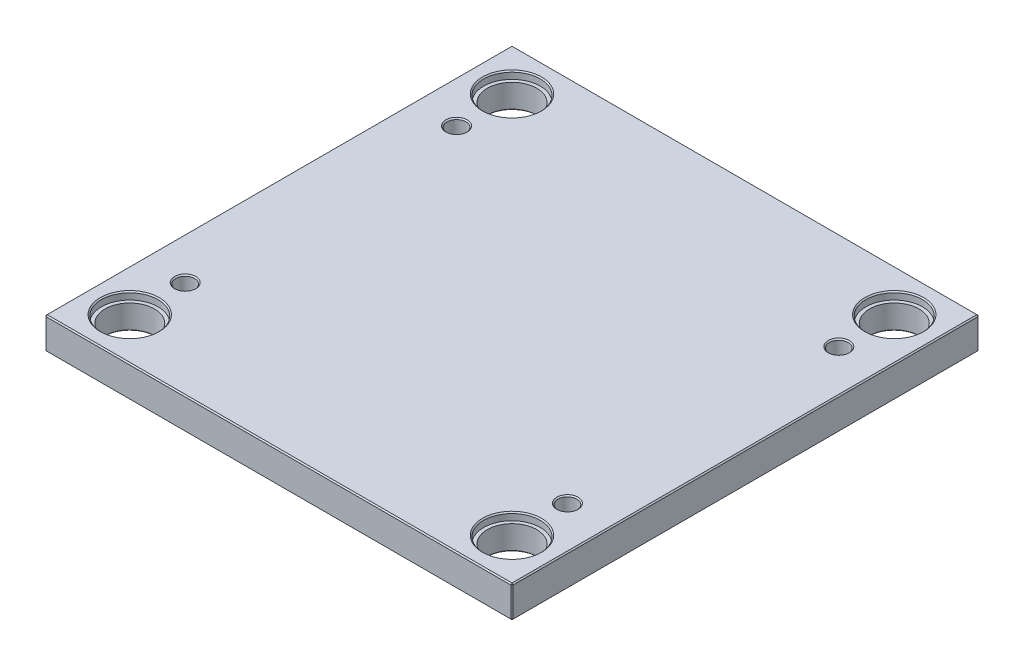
ISO-10303-21;
HEADER;
FILE_DESCRIPTION(('STEP AP214'),'2;1');
FILE_NAME('part.step','',(''),(''),'','','');
FILE_SCHEMA(('AUTOMOTIVE_DESIGN { 1 0 10303 214 1 1 1 1 }'));
ENDSEC;
DATA;
#1=APPLICATION_CONTEXT('core data for automotive mechanical design processes');
#2=APPLICATION_PROTOCOL_DEFINITION('international standard','automotive_design',2000,#1);
#3=PRODUCT_CONTEXT('',#1,'mechanical');
#4=PRODUCT('Part','Part','',(#3));
#5=PRODUCT_RELATED_PRODUCT_CATEGORY('part','',(#4));
#6=PRODUCT_DEFINITION_FORMATION('','',#4);
#7=PRODUCT_DEFINITION_CONTEXT('part definition',#1,'design');
#8=PRODUCT_DEFINITION('design','',#6,#7);
#9=PRODUCT_DEFINITION_SHAPE('','',#8);
#10=(LENGTH_UNIT() NAMED_UNIT(*) SI_UNIT(.MILLI.,.METRE.));
#11=(NAMED_UNIT(*) PLANE_ANGLE_UNIT() SI_UNIT($,.RADIAN.));
#12=(NAMED_UNIT(*) SI_UNIT($,.STERADIAN.) SOLID_ANGLE_UNIT());
#13=UNCERTAINTY_MEASURE_WITH_UNIT(LENGTH_MEASURE(1.E-05),#10,'distance_accuracy_value','');
#14=(GEOMETRIC_REPRESENTATION_CONTEXT(3) GLOBAL_UNCERTAINTY_ASSIGNED_CONTEXT((#13)) GLOBAL_UNIT_ASSIGNED_CONTEXT((#10,
#11,#12)) REPRESENTATION_CONTEXT('',''));
#15=CARTESIAN_POINT('',(0.,0.,0.));
#16=DIRECTION('',(0.,0.,1.));
#17=DIRECTION('',(1.,0.,0.));
#18=AXIS2_PLACEMENT_3D('',#15,#16,#17);
#19=CARTESIAN_POINT('',(-162.,0.,-162.));
#20=DIRECTION('',(0.,1.,0.));
#21=DIRECTION('',(0.,0.,1.));
#22=AXIS2_PLACEMENT_3D('',#19,#20,#21);
#23=CYLINDRICAL_SURFACE('',#22,21.);
#24=CARTESIAN_POINT('',(-162.,0.999999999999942,-162.));
#25=DIRECTION('',(0.,1.,0.));
#26=DIRECTION('',(0.,0.,1.));
#27=AXIS2_PLACEMENT_3D('',#24,#25,#26);
#28=CIRCLE('',#27,21.);
#29=CARTESIAN_POINT('',(-162.,0.999999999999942,-141.));
#30=VERTEX_POINT('',#29);
#31=EDGE_CURVE('E472',#30,#30,#28,.F.);
#32=ORIENTED_EDGE('',*,*,#31,.T.);
#33=EDGE_LOOP('',(#32));
#34=FACE_BOUND('',#33,.T.);
#35=CARTESIAN_POINT('',(-162.,20.7,-162.));
#36=DIRECTION('',(0.,1.,0.));
#37=DIRECTION('',(0.,0.,1.));
#38=AXIS2_PLACEMENT_3D('',#35,#36,#37);
#39=CIRCLE('',#38,21.);
#40=CARTESIAN_POINT('',(-162.,20.7,-141.));
#41=VERTEX_POINT('',#40);
#42=EDGE_CURVE('E221',#41,#41,#39,.F.);
#43=ORIENTED_EDGE('',*,*,#42,.F.);
#44=EDGE_LOOP('',(#43));
#45=FACE_BOUND('',#44,.T.);
#46=ADVANCED_FACE('F16',(#34,#45),#23,.F.);
#47=CARTESIAN_POINT('',(162.,0.,-162.));
#48=DIRECTION('',(0.,1.,0.));
#49=DIRECTION('',(0.,0.,1.));
#50=AXIS2_PLACEMENT_3D('',#47,#48,#49);
#51=CYLINDRICAL_SURFACE('',#50,21.);
#52=CARTESIAN_POINT('',(162.,0.999999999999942,-162.));
#53=DIRECTION('',(0.,1.,0.));
#54=DIRECTION('',(0.,0.,1.));
#55=AXIS2_PLACEMENT_3D('',#52,#53,#54);
#56=CIRCLE('',#55,21.);
#57=CARTESIAN_POINT('',(162.,0.999999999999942,-141.));
#58=VERTEX_POINT('',#57);
#59=EDGE_CURVE('E474',#58,#58,#56,.F.);
#60=ORIENTED_EDGE('',*,*,#59,.T.);
#61=EDGE_LOOP('',(#60));
#62=FACE_BOUND('',#61,.T.);
#63=CARTESIAN_POINT('',(162.,20.7,-162.));
#64=DIRECTION('',(0.,1.,0.));
#65=DIRECTION('',(0.,0.,1.));
#66=AXIS2_PLACEMENT_3D('',#63,#64,#65);
#67=CIRCLE('',#66,21.);
#68=CARTESIAN_POINT('',(162.,20.7,-141.));
#69=VERTEX_POINT('',#68);
#70=EDGE_CURVE('E218',#69,#69,#67,.F.);
#71=ORIENTED_EDGE('',*,*,#70,.F.);
#72=EDGE_LOOP('',(#71));
#73=FACE_BOUND('',#72,.T.);
#74=ADVANCED_FACE('F263',(#62,#73),#51,.F.);
#75=CARTESIAN_POINT('',(162.,0.,162.));
#76=DIRECTION('',(0.,1.,0.));
#77=DIRECTION('',(0.,0.,1.));
#78=AXIS2_PLACEMENT_3D('',#75,#76,#77);
#79=CYLINDRICAL_SURFACE('',#78,21.);
#80=CARTESIAN_POINT('',(162.,0.999999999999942,162.));
#81=DIRECTION('',(0.,1.,0.));
#82=DIRECTION('',(0.,0.,1.));
#83=AXIS2_PLACEMENT_3D('',#80,#81,#82);
#84=CIRCLE('',#83,21.);
#85=CARTESIAN_POINT('',(162.,0.999999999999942,183.));
#86=VERTEX_POINT('',#85);
#87=EDGE_CURVE('E477',#86,#86,#84,.F.);
#88=ORIENTED_EDGE('',*,*,#87,.T.);
#89=EDGE_LOOP('',(#88));
#90=FACE_BOUND('',#89,.T.);
#91=CARTESIAN_POINT('',(162.,20.7,162.));
#92=DIRECTION('',(0.,1.,0.));
#93=DIRECTION('',(0.,0.,1.));
#94=AXIS2_PLACEMENT_3D('',#91,#92,#93);
#95=CIRCLE('',#94,21.);
#96=CARTESIAN_POINT('',(162.,20.7,183.));
#97=VERTEX_POINT('',#96);
#98=EDGE_CURVE('E214',#97,#97,#95,.F.);
#99=ORIENTED_EDGE('',*,*,#98,.F.);
#100=EDGE_LOOP('',(#99));
#101=FACE_BOUND('',#100,.T.);
#102=ADVANCED_FACE('F270',(#90,#101),#79,.F.);
#103=CARTESIAN_POINT('',(-162.,0.,162.));
#104=DIRECTION('',(0.,1.,0.));
#105=DIRECTION('',(0.,0.,1.));
#106=AXIS2_PLACEMENT_3D('',#103,#104,#105);
#107=CYLINDRICAL_SURFACE('',#106,21.);
#108=CARTESIAN_POINT('',(-162.,0.999999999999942,162.));
#109=DIRECTION('',(0.,1.,0.));
#110=DIRECTION('',(0.,0.,1.));
#111=AXIS2_PLACEMENT_3D('',#108,#109,#110);
#112=CIRCLE('',#111,21.);
#113=CARTESIAN_POINT('',(-162.,0.999999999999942,183.));
#114=VERTEX_POINT('',#113);
#115=EDGE_CURVE('E480',#114,#114,#112,.F.);
#116=ORIENTED_EDGE('',*,*,#115,.T.);
#117=EDGE_LOOP('',(#116));
#118=FACE_BOUND('',#117,.T.);
#119=CARTESIAN_POINT('',(-162.,20.7,162.));
#120=DIRECTION('',(0.,1.,0.));
#121=DIRECTION('',(0.,0.,1.));
#122=AXIS2_PLACEMENT_3D('',#119,#120,#121);
#123=CIRCLE('',#122,21.);
#124=CARTESIAN_POINT('',(-162.,20.7,183.));
#125=VERTEX_POINT('',#124);
#126=EDGE_CURVE('E211',#125,#125,#123,.F.);
#127=ORIENTED_EDGE('',*,*,#126,.F.);
#128=EDGE_LOOP('',(#127));
#129=FACE_BOUND('',#128,.T.);
#130=ADVANCED_FACE('F277',(#118,#129),#107,.F.);
#131=CARTESIAN_POINT('',(-198.,27.,198.));
#132=DIRECTION('',(1.,0.,0.));
#133=DIRECTION('',(0.,0.,-1.));
#134=AXIS2_PLACEMENT_3D('',#131,#132,#133);
#135=PLANE('',#134);
#136=DIRECTION('',(0.,-1.,0.));
#137=VECTOR('',#136,1.);
#138=CARTESIAN_POINT('',(-198.,27.,-197.));
#139=LINE('',#138,#137);
#140=CARTESIAN_POINT('',(-198.,26.,-197.));
#141=VERTEX_POINT('',#140);
#142=CARTESIAN_POINT('',(-198.,0.999999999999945,-197.));
#143=VERTEX_POINT('',#142);
#144=EDGE_CURVE('E487',#141,#143,#139,.T.);
#145=ORIENTED_EDGE('',*,*,#144,.T.);
#146=DIRECTION('',(0.,0.,1.));
#147=VECTOR('',#146,1.);
#148=CARTESIAN_POINT('',(-198.,0.999999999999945,198.));
#149=LINE('',#148,#147);
#150=CARTESIAN_POINT('',(-198.,0.999999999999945,197.));
#151=VERTEX_POINT('',#150);
#152=EDGE_CURVE('E490',#143,#151,#149,.T.);
#153=ORIENTED_EDGE('',*,*,#152,.T.);
#154=DIRECTION('',(0.,1.,0.));
#155=VECTOR('',#154,1.);
#156=CARTESIAN_POINT('',(-198.,27.,197.));
#157=LINE('',#156,#155);
#158=CARTESIAN_POINT('',(-198.,26.,197.));
#159=VERTEX_POINT('',#158);
#160=EDGE_CURVE('E485',#151,#159,#157,.T.);
#161=ORIENTED_EDGE('',*,*,#160,.T.);
#162=DIRECTION('',(0.,0.,-1.));
#163=VECTOR('',#162,1.);
#164=CARTESIAN_POINT('',(-198.,26.,-198.));
#165=LINE('',#164,#163);
#166=EDGE_CURVE('E483',#159,#141,#165,.T.);
#167=ORIENTED_EDGE('',*,*,#166,.T.);
#168=EDGE_LOOP('',(#145,#153,#161,#167));
#169=FACE_BOUND('',#168,.T.);
#170=ADVANCED_FACE('F298',(#169),#135,.F.);
#171=CARTESIAN_POINT('',(198.,27.,198.));
#172=DIRECTION('',(0.,0.,-1.));
#173=DIRECTION('',(-1.,0.,0.));
#174=AXIS2_PLACEMENT_3D('',#171,#172,#173);
#175=PLANE('',#174);
#176=DIRECTION('',(-1.,0.,0.));
#177=VECTOR('',#176,1.);
#178=CARTESIAN_POINT('',(-198.,26.,198.));
#179=LINE('',#178,#177);
#180=CARTESIAN_POINT('',(197.,26.,198.));
#181=VERTEX_POINT('',#180);
#182=CARTESIAN_POINT('',(-197.,26.,198.));
#183=VERTEX_POINT('',#182);
#184=EDGE_CURVE('E509',#181,#183,#179,.T.);
#185=ORIENTED_EDGE('',*,*,#184,.T.);
#186=DIRECTION('',(0.,-1.,0.));
#187=VECTOR('',#186,1.);
#188=CARTESIAN_POINT('',(-197.,27.,198.));
#189=LINE('',#188,#187);
#190=CARTESIAN_POINT('',(-197.,0.999999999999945,198.));
#191=VERTEX_POINT('',#190);
#192=EDGE_CURVE('E515',#183,#191,#189,.T.);
#193=ORIENTED_EDGE('',*,*,#192,.T.);
#194=DIRECTION('',(1.,0.,0.));
#195=VECTOR('',#194,1.);
#196=CARTESIAN_POINT('',(198.,0.999999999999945,198.));
#197=LINE('',#196,#195);
#198=CARTESIAN_POINT('',(197.,0.999999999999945,198.));
#199=VERTEX_POINT('',#198);
#200=EDGE_CURVE('E513',#191,#199,#197,.T.);
#201=ORIENTED_EDGE('',*,*,#200,.T.);
#202=DIRECTION('',(0.,1.,0.));
#203=VECTOR('',#202,1.);
#204=CARTESIAN_POINT('',(197.,27.,198.));
#205=LINE('',#204,#203);
#206=EDGE_CURVE('E511',#199,#181,#205,.T.);
#207=ORIENTED_EDGE('',*,*,#206,.T.);
#208=EDGE_LOOP('',(#185,#193,#201,#207));
#209=FACE_BOUND('',#208,.T.);
#210=ADVANCED_FACE('F294',(#209),#175,.F.);
#211=CARTESIAN_POINT('',(198.,27.,198.));
#212=DIRECTION('',(-1.,0.,0.));
#213=DIRECTION('',(0.,0.,1.));
#214=AXIS2_PLACEMENT_3D('',#211,#212,#213);
#215=PLANE('',#214);
#216=DIRECTION('',(0.,0.,-1.));
#217=VECTOR('',#216,1.);
#218=CARTESIAN_POINT('',(198.,0.999999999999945,198.));
#219=LINE('',#218,#217);
#220=CARTESIAN_POINT('',(198.,0.999999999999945,197.));
#221=VERTEX_POINT('',#220);
#222=CARTESIAN_POINT('',(198.,0.999999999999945,-197.));
#223=VERTEX_POINT('',#222);
#224=EDGE_CURVE('E504',#221,#223,#219,.T.);
#225=ORIENTED_EDGE('',*,*,#224,.T.);
#226=DIRECTION('',(0.,1.,0.));
#227=VECTOR('',#226,1.);
#228=CARTESIAN_POINT('',(198.,27.,-197.));
#229=LINE('',#228,#227);
#230=CARTESIAN_POINT('',(198.,26.,-197.));
#231=VERTEX_POINT('',#230);
#232=EDGE_CURVE('E506',#223,#231,#229,.T.);
#233=ORIENTED_EDGE('',*,*,#232,.T.);
#234=DIRECTION('',(0.,0.,1.));
#235=VECTOR('',#234,1.);
#236=CARTESIAN_POINT('',(198.,26.,198.));
#237=LINE('',#236,#235);
#238=CARTESIAN_POINT('',(198.,26.,197.));
#239=VERTEX_POINT('',#238);
#240=EDGE_CURVE('E500',#231,#239,#237,.T.);
#241=ORIENTED_EDGE('',*,*,#240,.T.);
#242=DIRECTION('',(0.,-1.,0.));
#243=VECTOR('',#242,1.);
#244=CARTESIAN_POINT('',(198.,27.,197.));
#245=LINE('',#244,#243);
#246=EDGE_CURVE('E502',#239,#221,#245,.T.);
#247=ORIENTED_EDGE('',*,*,#246,.T.);
#248=EDGE_LOOP('',(#225,#233,#241,#247));
#249=FACE_BOUND('',#248,.T.);
#250=ADVANCED_FACE('F290',(#249),#215,.F.);
#251=CARTESIAN_POINT('',(198.,27.,-198.));
#252=DIRECTION('',(0.,0.,1.));
#253=DIRECTION('',(1.,0.,0.));
#254=AXIS2_PLACEMENT_3D('',#251,#252,#253);
#255=PLANE('',#254);
#256=DIRECTION('',(0.,-1.,0.));
#257=VECTOR('',#256,1.);
#258=CARTESIAN_POINT('',(197.,27.,-198.));
#259=LINE('',#258,#257);
#260=CARTESIAN_POINT('',(197.,26.,-198.));
#261=VERTEX_POINT('',#260);
#262=CARTESIAN_POINT('',(197.,0.999999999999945,-198.));
#263=VERTEX_POINT('',#262);
#264=EDGE_CURVE('E494',#261,#263,#259,.T.);
#265=ORIENTED_EDGE('',*,*,#264,.T.);
#266=DIRECTION('',(-1.,0.,0.));
#267=VECTOR('',#266,1.);
#268=CARTESIAN_POINT('',(198.,0.999999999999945,-198.));
#269=LINE('',#268,#267);
#270=CARTESIAN_POINT('',(-197.,0.999999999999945,-198.));
#271=VERTEX_POINT('',#270);
#272=EDGE_CURVE('E138',#263,#271,#269,.T.);
#273=ORIENTED_EDGE('',*,*,#272,.T.);
#274=DIRECTION('',(0.,1.,0.));
#275=VECTOR('',#274,1.);
#276=CARTESIAN_POINT('',(-197.,27.,-198.));
#277=LINE('',#276,#275);
#278=CARTESIAN_POINT('',(-197.,26.,-198.));
#279=VERTEX_POINT('',#278);
#280=EDGE_CURVE('E496',#271,#279,#277,.T.);
#281=ORIENTED_EDGE('',*,*,#280,.T.);
#282=DIRECTION('',(1.,0.,0.));
#283=VECTOR('',#282,1.);
#284=CARTESIAN_POINT('',(198.,26.,-198.));
#285=LINE('',#284,#283);
#286=EDGE_CURVE('E492',#279,#261,#285,.T.);
#287=ORIENTED_EDGE('',*,*,#286,.T.);
#288=EDGE_LOOP('',(#265,#273,#281,#287));
#289=FACE_BOUND('',#288,.T.);
#290=ADVANCED_FACE('F282',(#289),#255,.F.);
#291=CARTESIAN_POINT('',(0.,27.,0.));
#292=DIRECTION('',(0.,1.,0.));
#293=DIRECTION('',(0.,0.,1.));
#294=AXIS2_PLACEMENT_3D('',#291,#292,#293);
#295=PLANE('',#294);
#296=CARTESIAN_POINT('',(162.,27.,162.));
#297=DIRECTION('',(0.,1.,0.));
#298=DIRECTION('',(0.,0.,1.));
#299=AXIS2_PLACEMENT_3D('',#296,#297,#298);
#300=CIRCLE('',#299,25.);
#301=CARTESIAN_POINT('',(162.,27.,187.));
#302=VERTEX_POINT('',#301);
#303=EDGE_CURVE('E236',#302,#302,#300,.F.);
#304=ORIENTED_EDGE('',*,*,#303,.T.);
#305=EDGE_LOOP('',(#304));
#306=FACE_BOUND('',#305,.T.);
#307=CARTESIAN_POINT('',(-162.,27.,162.));
#308=DIRECTION('',(0.,1.,0.));
#309=DIRECTION('',(0.,0.,1.));
#310=AXIS2_PLACEMENT_3D('',#307,#308,#309);
#311=CIRCLE('',#310,25.);
#312=CARTESIAN_POINT('',(-162.,27.,187.));
#313=VERTEX_POINT('',#312);
#314=EDGE_CURVE('E233',#313,#313,#311,.F.);
#315=ORIENTED_EDGE('',*,*,#314,.T.);
#316=EDGE_LOOP('',(#315));
#317=FACE_BOUND('',#316,.T.);
#318=CARTESIAN_POINT('',(162.,27.,-162.));
#319=DIRECTION('',(0.,1.,0.));
#320=DIRECTION('',(0.,0.,1.));
#321=AXIS2_PLACEMENT_3D('',#318,#319,#320);
#322=CIRCLE('',#321,25.);
#323=CARTESIAN_POINT('',(162.,27.,-137.));
#324=VERTEX_POINT('',#323);
#325=EDGE_CURVE('E230',#324,#324,#322,.F.);
#326=ORIENTED_EDGE('',*,*,#325,.T.);
#327=EDGE_LOOP('',(#326));
#328=FACE_BOUND('',#327,.T.);
#329=CARTESIAN_POINT('',(-162.,27.,-162.));
#330=DIRECTION('',(0.,1.,0.));
#331=DIRECTION('',(0.,0.,1.));
#332=AXIS2_PLACEMENT_3D('',#329,#330,#331);
#333=CIRCLE('',#332,25.);
#334=CARTESIAN_POINT('',(-162.,27.,-137.));
#335=VERTEX_POINT('',#334);
#336=EDGE_CURVE('E227',#335,#335,#333,.F.);
#337=ORIENTED_EDGE('',*,*,#336,.T.);
#338=EDGE_LOOP('',(#337));
#339=FACE_BOUND('',#338,.T.);
#340=CARTESIAN_POINT('',(-162.,27.,115.));
#341=DIRECTION('',(0.,1.,0.));
#342=DIRECTION('',(0.,0.,1.));
#343=AXIS2_PLACEMENT_3D('',#340,#341,#342);
#344=CIRCLE('',#343,9.00000000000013);
#345=CARTESIAN_POINT('',(-162.,27.,124.));
#346=VERTEX_POINT('',#345);
#347=EDGE_CURVE('E198',#346,#346,#344,.F.);
#348=ORIENTED_EDGE('',*,*,#347,.T.);
#349=EDGE_LOOP('',(#348));
#350=FACE_BOUND('',#349,.T.);
#351=CARTESIAN_POINT('',(162.,27.,115.));
#352=DIRECTION('',(0.,1.,0.));
#353=DIRECTION('',(0.,0.,1.));
#354=AXIS2_PLACEMENT_3D('',#351,#352,#353);
#355=CIRCLE('',#354,9.00000000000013);
#356=CARTESIAN_POINT('',(162.,27.,124.));
#357=VERTEX_POINT('',#356);
#358=EDGE_CURVE('E195',#357,#357,#355,.F.);
#359=ORIENTED_EDGE('',*,*,#358,.T.);
#360=EDGE_LOOP('',(#359));
#361=FACE_BOUND('',#360,.T.);
#362=CARTESIAN_POINT('',(162.,27.,-115.));
#363=DIRECTION('',(0.,1.,0.));
#364=DIRECTION('',(0.,0.,1.));
#365=AXIS2_PLACEMENT_3D('',#362,#363,#364);
#366=CIRCLE('',#365,9.00000000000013);
#367=CARTESIAN_POINT('',(162.,27.,-106.));
#368=VERTEX_POINT('',#367);
#369=EDGE_CURVE('E192',#368,#368,#366,.F.);
#370=ORIENTED_EDGE('',*,*,#369,.T.);
#371=EDGE_LOOP('',(#370));
#372=FACE_BOUND('',#371,.T.);
#373=CARTESIAN_POINT('',(-162.,27.,-115.));
#374=DIRECTION('',(0.,1.,0.));
#375=DIRECTION('',(0.,0.,1.));
#376=AXIS2_PLACEMENT_3D('',#373,#374,#375);
#377=CIRCLE('',#376,9.00000000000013);
#378=CARTESIAN_POINT('',(-162.,27.,-106.));
#379=VERTEX_POINT('',#378);
#380=EDGE_CURVE('E188',#379,#379,#377,.F.);
#381=ORIENTED_EDGE('',*,*,#380,.T.);
#382=EDGE_LOOP('',(#381));
#383=FACE_BOUND('',#382,.T.);
#384=DIRECTION('',(0.,0.,-1.));
#385=VECTOR('',#384,1.);
#386=CARTESIAN_POINT('',(197.,27.,-198.));
#387=LINE('',#386,#385);
#388=CARTESIAN_POINT('',(197.,27.,197.));
#389=VERTEX_POINT('',#388);
#390=CARTESIAN_POINT('',(197.,27.,-197.));
#391=VERTEX_POINT('',#390);
#392=EDGE_CURVE('E31',#389,#391,#387,.T.);
#393=ORIENTED_EDGE('',*,*,#392,.T.);
#394=DIRECTION('',(-1.,0.,0.));
#395=VECTOR('',#394,1.);
#396=CARTESIAN_POINT('',(-198.,27.,-197.));
#397=LINE('',#396,#395);
#398=CARTESIAN_POINT('',(-197.,27.,-197.));
#399=VERTEX_POINT('',#398);
#400=EDGE_CURVE('E189',#391,#399,#397,.T.);
#401=ORIENTED_EDGE('',*,*,#400,.T.);
#402=DIRECTION('',(0.,0.,1.));
#403=VECTOR('',#402,1.);
#404=CARTESIAN_POINT('',(-197.,27.,198.));
#405=LINE('',#404,#403);
#406=CARTESIAN_POINT('',(-197.,27.,197.));
#407=VERTEX_POINT('',#406);
#408=EDGE_CURVE('E518',#399,#407,#405,.T.);
#409=ORIENTED_EDGE('',*,*,#408,.T.);
#410=DIRECTION('',(1.,0.,0.));
#411=VECTOR('',#410,1.);
#412=CARTESIAN_POINT('',(198.,27.,197.));
#413=LINE('',#412,#411);
#414=EDGE_CURVE('E36',#407,#389,#413,.T.);
#415=ORIENTED_EDGE('',*,*,#414,.T.);
#416=EDGE_LOOP('',(#393,#401,#409,#415));
#417=FACE_BOUND('',#416,.T.);
#418=ADVANCED_FACE('F279',(#306,#317,#328,#339,#350,#361,#372,#383,#417),#295,.T.);
#419=CARTESIAN_POINT('',(0.,0.,0.));
#420=DIRECTION('',(0.,1.,0.));
#421=DIRECTION('',(0.,0.,1.));
#422=AXIS2_PLACEMENT_3D('',#419,#420,#421);
#423=PLANE('',#422);
#424=CARTESIAN_POINT('',(-162.,0.,-162.));
#425=DIRECTION('',(0.,1.,0.));
#426=DIRECTION('',(0.,0.,1.));
#427=AXIS2_PLACEMENT_3D('',#424,#425,#426);
#428=CIRCLE('',#427,22.);
#429=CARTESIAN_POINT('',(-162.,0.,-140.));
#430=VERTEX_POINT('',#429);
#431=EDGE_CURVE('E469',#430,#430,#428,.T.);
#432=ORIENTED_EDGE('',*,*,#431,.T.);
#433=EDGE_LOOP('',(#432));
#434=FACE_BOUND('',#433,.T.);
#435=CARTESIAN_POINT('',(162.,0.,-162.));
#436=DIRECTION('',(0.,1.,0.));
#437=DIRECTION('',(0.,0.,1.));
#438=AXIS2_PLACEMENT_3D('',#435,#436,#437);
#439=CIRCLE('',#438,22.);
#440=CARTESIAN_POINT('',(162.,0.,-140.));
#441=VERTEX_POINT('',#440);
#442=EDGE_CURVE('E466',#441,#441,#439,.T.);
#443=ORIENTED_EDGE('',*,*,#442,.T.);
#444=EDGE_LOOP('',(#443));
#445=FACE_BOUND('',#444,.T.);
#446=CARTESIAN_POINT('',(162.,0.,162.));
#447=DIRECTION('',(0.,1.,0.));
#448=DIRECTION('',(0.,0.,1.));
#449=AXIS2_PLACEMENT_3D('',#446,#447,#448);
#450=CIRCLE('',#449,22.);
#451=CARTESIAN_POINT('',(162.,0.,184.));
#452=VERTEX_POINT('',#451);
#453=EDGE_CURVE('E463',#452,#452,#450,.T.);
#454=ORIENTED_EDGE('',*,*,#453,.T.);
#455=EDGE_LOOP('',(#454));
#456=FACE_BOUND('',#455,.T.);
#457=CARTESIAN_POINT('',(-162.,0.,162.));
#458=DIRECTION('',(0.,1.,0.));
#459=DIRECTION('',(0.,0.,1.));
#460=AXIS2_PLACEMENT_3D('',#457,#458,#459);
#461=CIRCLE('',#460,22.);
#462=CARTESIAN_POINT('',(-162.,0.,184.));
#463=VERTEX_POINT('',#462);
#464=EDGE_CURVE('E460',#463,#463,#461,.T.);
#465=ORIENTED_EDGE('',*,*,#464,.T.);
#466=EDGE_LOOP('',(#465));
#467=FACE_BOUND('',#466,.T.);
#468=DIRECTION('',(0.,0.,1.));
#469=VECTOR('',#468,1.);
#470=CARTESIAN_POINT('',(197.,0.,0.));
#471=LINE('',#470,#469);
#472=CARTESIAN_POINT('',(197.,0.,-197.));
#473=VERTEX_POINT('',#472);
#474=CARTESIAN_POINT('',(197.,0.,197.));
#475=VERTEX_POINT('',#474);
#476=EDGE_CURVE('E108',#473,#475,#471,.T.);
#477=ORIENTED_EDGE('',*,*,#476,.T.);
#478=DIRECTION('',(-1.,0.,0.));
#479=VECTOR('',#478,1.);
#480=CARTESIAN_POINT('',(0.,0.,197.));
#481=LINE('',#480,#479);
#482=CARTESIAN_POINT('',(-197.,0.,197.));
#483=VERTEX_POINT('',#482);
#484=EDGE_CURVE('E458',#475,#483,#481,.T.);
#485=ORIENTED_EDGE('',*,*,#484,.T.);
#486=DIRECTION('',(0.,0.,-1.));
#487=VECTOR('',#486,1.);
#488=CARTESIAN_POINT('',(-197.,0.,0.));
#489=LINE('',#488,#487);
#490=CARTESIAN_POINT('',(-197.,0.,-197.));
#491=VERTEX_POINT('',#490);
#492=EDGE_CURVE('E110',#483,#491,#489,.T.);
#493=ORIENTED_EDGE('',*,*,#492,.T.);
#494=DIRECTION('',(1.,0.,0.));
#495=VECTOR('',#494,1.);
#496=CARTESIAN_POINT('',(0.,0.,-197.));
#497=LINE('',#496,#495);
#498=EDGE_CURVE('E104',#491,#473,#497,.T.);
#499=ORIENTED_EDGE('',*,*,#498,.T.);
#500=EDGE_LOOP('',(#477,#485,#493,#499));
#501=FACE_BOUND('',#500,.T.);
#502=ADVANCED_FACE('F106',(#434,#445,#456,#467,#501),#423,.F.);
#503=CARTESIAN_POINT('',(-162.,0.,-162.));
#504=DIRECTION('',(0.,-1.,0.));
#505=DIRECTION('',(0.,0.,-1.));
#506=AXIS2_PLACEMENT_3D('',#503,#504,#505);
#507=CONICAL_SURFACE('',#506,22.,0.785398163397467);
#508=ORIENTED_EDGE('',*,*,#31,.F.);
#509=EDGE_LOOP('',(#508));
#510=FACE_BOUND('',#509,.T.);
#511=ORIENTED_EDGE('',*,*,#431,.F.);
#512=EDGE_LOOP('',(#511));
#513=FACE_BOUND('',#512,.T.);
#514=ADVANCED_FACE('F286',(#510,#513),#507,.F.);
#515=CARTESIAN_POINT('',(162.,0.,-162.));
#516=DIRECTION('',(0.,-1.,0.));
#517=DIRECTION('',(0.,0.,-1.));
#518=AXIS2_PLACEMENT_3D('',#515,#516,#517);
#519=CONICAL_SURFACE('',#518,22.,0.785398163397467);
#520=ORIENTED_EDGE('',*,*,#59,.F.);
#521=EDGE_LOOP('',(#520));
#522=FACE_BOUND('',#521,.T.);
#523=ORIENTED_EDGE('',*,*,#442,.F.);
#524=EDGE_LOOP('',(#523));
#525=FACE_BOUND('',#524,.T.);
#526=ADVANCED_FACE('F305',(#522,#525),#519,.F.);
#527=CARTESIAN_POINT('',(162.,0.,162.));
#528=DIRECTION('',(0.,-1.,0.));
#529=DIRECTION('',(0.,0.,-1.));
#530=AXIS2_PLACEMENT_3D('',#527,#528,#529);
#531=CONICAL_SURFACE('',#530,22.,0.785398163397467);
#532=ORIENTED_EDGE('',*,*,#87,.F.);
#533=EDGE_LOOP('',(#532));
#534=FACE_BOUND('',#533,.T.);
#535=ORIENTED_EDGE('',*,*,#453,.F.);
#536=EDGE_LOOP('',(#535));
#537=FACE_BOUND('',#536,.T.);
#538=ADVANCED_FACE('F309',(#534,#537),#531,.F.);
#539=CARTESIAN_POINT('',(-162.,0.,162.));
#540=DIRECTION('',(0.,-1.,0.));
#541=DIRECTION('',(0.,0.,-1.));
#542=AXIS2_PLACEMENT_3D('',#539,#540,#541);
#543=CONICAL_SURFACE('',#542,22.,0.785398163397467);
#544=ORIENTED_EDGE('',*,*,#115,.F.);
#545=EDGE_LOOP('',(#544));
#546=FACE_BOUND('',#545,.T.);
#547=ORIENTED_EDGE('',*,*,#464,.F.);
#548=EDGE_LOOP('',(#547));
#549=FACE_BOUND('',#548,.T.);
#550=ADVANCED_FACE('F313',(#546,#549),#543,.F.);
#551=CARTESIAN_POINT('',(198.,27.,197.));
#552=DIRECTION('',(-0.707106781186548,0.,-0.707106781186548));
#553=DIRECTION('',(0.,-1.,0.));
#554=AXIS2_PLACEMENT_3D('',#551,#552,#553);
#555=PLANE('',#554);
#556=DIRECTION('',(-0.707106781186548,0.,0.707106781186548));
#557=VECTOR('',#556,1.);
#558=CARTESIAN_POINT('',(197.,26.,198.));
#559=LINE('',#558,#557);
#560=EDGE_CURVE('E126',#181,#239,#559,.F.);
#561=ORIENTED_EDGE('',*,*,#560,.F.);
#562=ORIENTED_EDGE('',*,*,#206,.F.);
#563=DIRECTION('',(0.707106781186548,0.,-0.707106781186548));
#564=VECTOR('',#563,1.);
#565=CARTESIAN_POINT('',(197.,0.999999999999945,198.));
#566=LINE('',#565,#564);
#567=EDGE_CURVE('E180',#221,#199,#566,.F.);
#568=ORIENTED_EDGE('',*,*,#567,.F.);
#569=ORIENTED_EDGE('',*,*,#246,.F.);
#570=EDGE_LOOP('',(#561,#562,#568,#569));
#571=FACE_BOUND('',#570,.T.);
#572=ADVANCED_FACE('F317',(#571),#555,.F.);
#573=CARTESIAN_POINT('',(197.,26.,198.));
#574=DIRECTION('',(0.577350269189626,0.577350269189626,0.577350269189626));
#575=DIRECTION('',(0.707106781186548,0.,-0.707106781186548));
#576=AXIS2_PLACEMENT_3D('',#573,#574,#575);
#577=PLANE('',#576);
#578=DIRECTION('',(0.,-0.707106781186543,0.707106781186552));
#579=VECTOR('',#578,1.);
#580=CARTESIAN_POINT('',(197.,26.,198.));
#581=LINE('',#580,#579);
#582=EDGE_CURVE('E175',#181,#389,#581,.F.);
#583=ORIENTED_EDGE('',*,*,#582,.F.);
#584=ORIENTED_EDGE('',*,*,#560,.T.);
#585=DIRECTION('',(-0.707106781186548,0.707106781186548,0.));
#586=VECTOR('',#585,1.);
#587=CARTESIAN_POINT('',(197.5,26.5,197.));
#588=LINE('',#587,#586);
#589=EDGE_CURVE('E177',#389,#239,#588,.F.);
#590=ORIENTED_EDGE('',*,*,#589,.F.);
#591=EDGE_LOOP('',(#583,#584,#590));
#592=FACE_BOUND('',#591,.T.);
#593=ADVANCED_FACE('F385',(#592),#577,.T.);
#594=CARTESIAN_POINT('',(197.,0.999999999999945,198.));
#595=DIRECTION('',(0.577350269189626,-0.577350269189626,0.577350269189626));
#596=DIRECTION('',(0.707106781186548,0.,-0.707106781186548));
#597=AXIS2_PLACEMENT_3D('',#594,#595,#596);
#598=PLANE('',#597);
#599=DIRECTION('',(-0.707106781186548,-0.707106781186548,0.));
#600=VECTOR('',#599,1.);
#601=CARTESIAN_POINT('',(197.5,0.499999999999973,197.));
#602=LINE('',#601,#600);
#603=EDGE_CURVE('E124',#221,#475,#602,.T.);
#604=ORIENTED_EDGE('',*,*,#603,.F.);
#605=ORIENTED_EDGE('',*,*,#567,.T.);
#606=DIRECTION('',(0.,0.707106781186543,0.707106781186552));
#607=VECTOR('',#606,1.);
#608=CARTESIAN_POINT('',(197.,0.999999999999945,198.));
#609=LINE('',#608,#607);
#610=EDGE_CURVE('E172',#475,#199,#609,.T.);
#611=ORIENTED_EDGE('',*,*,#610,.F.);
#612=EDGE_LOOP('',(#604,#605,#611));
#613=FACE_BOUND('',#612,.T.);
#614=ADVANCED_FACE('F381',(#613),#598,.T.);
#615=CARTESIAN_POINT('',(197.,27.,0.));
#616=DIRECTION('',(0.707106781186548,0.707106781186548,0.));
#617=DIRECTION('',(0.,0.,1.));
#618=AXIS2_PLACEMENT_3D('',#615,#616,#617);
#619=PLANE('',#618);
#620=ORIENTED_EDGE('',*,*,#589,.T.);
#621=ORIENTED_EDGE('',*,*,#240,.F.);
#622=DIRECTION('',(0.707106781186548,-0.707106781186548,0.));
#623=VECTOR('',#622,1.);
#624=CARTESIAN_POINT('',(198.,26.,-197.));
#625=LINE('',#624,#623);
#626=EDGE_CURVE('E166',#391,#231,#625,.T.);
#627=ORIENTED_EDGE('',*,*,#626,.F.);
#628=ORIENTED_EDGE('',*,*,#392,.F.);
#629=EDGE_LOOP('',(#620,#621,#627,#628));
#630=FACE_BOUND('',#629,.T.);
#631=ADVANCED_FACE('F377',(#630),#619,.T.);
#632=CARTESIAN_POINT('',(0.,27.,197.));
#633=DIRECTION('',(0.,0.707106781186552,0.707106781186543));
#634=DIRECTION('',(-1.,0.,0.));
#635=AXIS2_PLACEMENT_3D('',#632,#633,#634);
#636=PLANE('',#635);
#637=ORIENTED_EDGE('',*,*,#582,.T.);
#638=ORIENTED_EDGE('',*,*,#414,.F.);
#639=DIRECTION('',(0.,0.707106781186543,-0.707106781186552));
#640=VECTOR('',#639,1.);
#641=CARTESIAN_POINT('',(-197.,26.5,197.5));
#642=LINE('',#641,#640);
#643=EDGE_CURVE('E163',#183,#407,#642,.T.);
#644=ORIENTED_EDGE('',*,*,#643,.F.);
#645=ORIENTED_EDGE('',*,*,#184,.F.);
#646=EDGE_LOOP('',(#637,#638,#644,#645));
#647=FACE_BOUND('',#646,.T.);
#648=ADVANCED_FACE('F373',(#647),#636,.T.);
#649=CARTESIAN_POINT('',(-197.,27.,198.));
#650=DIRECTION('',(0.707106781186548,0.,-0.707106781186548));
#651=DIRECTION('',(0.,-1.,0.));
#652=AXIS2_PLACEMENT_3D('',#649,#650,#651);
#653=PLANE('',#652);
#654=DIRECTION('',(0.707106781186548,0.,0.707106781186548));
#655=VECTOR('',#654,1.);
#656=CARTESIAN_POINT('',(-197.,0.999999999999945,198.));
#657=LINE('',#656,#655);
#658=EDGE_CURVE('E157',#191,#151,#657,.F.);
#659=ORIENTED_EDGE('',*,*,#658,.F.);
#660=ORIENTED_EDGE('',*,*,#192,.F.);
#661=DIRECTION('',(-0.707106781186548,0.,-0.707106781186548));
#662=VECTOR('',#661,1.);
#663=CARTESIAN_POINT('',(-198.,26.,197.));
#664=LINE('',#663,#662);
#665=EDGE_CURVE('E160',#159,#183,#664,.F.);
#666=ORIENTED_EDGE('',*,*,#665,.F.);
#667=ORIENTED_EDGE('',*,*,#160,.F.);
#668=EDGE_LOOP('',(#659,#660,#666,#667));
#669=FACE_BOUND('',#668,.T.);
#670=ADVANCED_FACE('F369',(#669),#653,.F.);
#671=CARTESIAN_POINT('',(198.,0.999999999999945,198.));
#672=DIRECTION('',(0.,0.707106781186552,-0.707106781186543));
#673=DIRECTION('',(1.,0.,0.));
#674=AXIS2_PLACEMENT_3D('',#671,#672,#673);
#675=PLANE('',#674);
#676=ORIENTED_EDGE('',*,*,#610,.T.);
#677=ORIENTED_EDGE('',*,*,#200,.F.);
#678=DIRECTION('',(0.,-0.707106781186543,-0.707106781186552));
#679=VECTOR('',#678,1.);
#680=CARTESIAN_POINT('',(-197.,0.999999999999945,198.));
#681=LINE('',#680,#679);
#682=EDGE_CURVE('E135',#483,#191,#681,.F.);
#683=ORIENTED_EDGE('',*,*,#682,.F.);
#684=ORIENTED_EDGE('',*,*,#484,.F.);
#685=EDGE_LOOP('',(#676,#677,#683,#684));
#686=FACE_BOUND('',#685,.T.);
#687=ADVANCED_FACE('F366',(#686),#675,.F.);
#688=CARTESIAN_POINT('',(198.,0.999999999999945,198.));
#689=DIRECTION('',(-0.707106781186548,0.707106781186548,0.));
#690=DIRECTION('',(0.,0.,-1.));
#691=AXIS2_PLACEMENT_3D('',#688,#689,#690);
#692=PLANE('',#691);
#693=ORIENTED_EDGE('',*,*,#603,.T.);
#694=ORIENTED_EDGE('',*,*,#476,.F.);
#695=DIRECTION('',(0.707106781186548,0.707106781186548,0.));
#696=VECTOR('',#695,1.);
#697=CARTESIAN_POINT('',(197.5,0.499999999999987,-197.));
#698=LINE('',#697,#696);
#699=EDGE_CURVE('E121',#223,#473,#698,.F.);
#700=ORIENTED_EDGE('',*,*,#699,.F.);
#701=ORIENTED_EDGE('',*,*,#224,.F.);
#702=EDGE_LOOP('',(#693,#694,#700,#701));
#703=FACE_BOUND('',#702,.T.);
#704=ADVANCED_FACE('F119',(#703),#692,.F.);
#705=CARTESIAN_POINT('',(197.,27.,-198.));
#706=DIRECTION('',(-0.707106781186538,0.,0.707106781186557));
#707=DIRECTION('',(0.,-1.,0.));
#708=AXIS2_PLACEMENT_3D('',#705,#706,#707);
#709=PLANE('',#708);
#710=DIRECTION('',(0.707106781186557,0.,0.707106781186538));
#711=VECTOR('',#710,1.);
#712=CARTESIAN_POINT('',(198.,26.,-197.));
#713=LINE('',#712,#711);
#714=EDGE_CURVE('E168',#231,#261,#713,.F.);
#715=ORIENTED_EDGE('',*,*,#714,.F.);
#716=ORIENTED_EDGE('',*,*,#232,.F.);
#717=DIRECTION('',(-0.707106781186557,0.,-0.707106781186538));
#718=VECTOR('',#717,1.);
#719=CARTESIAN_POINT('',(197.,0.999999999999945,-198.));
#720=LINE('',#719,#718);
#721=EDGE_CURVE('E134',#263,#223,#720,.F.);
#722=ORIENTED_EDGE('',*,*,#721,.F.);
#723=ORIENTED_EDGE('',*,*,#264,.F.);
#724=EDGE_LOOP('',(#715,#716,#722,#723));
#725=FACE_BOUND('',#724,.T.);
#726=ADVANCED_FACE('F359',(#725),#709,.F.);
#727=CARTESIAN_POINT('',(198.,26.,-197.));
#728=DIRECTION('',(0.577350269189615,0.577350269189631,-0.577350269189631));
#729=DIRECTION('',(0.,0.707106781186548,0.707106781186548));
#730=AXIS2_PLACEMENT_3D('',#727,#728,#729);
#731=PLANE('',#730);
#732=ORIENTED_EDGE('',*,*,#626,.T.);
#733=ORIENTED_EDGE('',*,*,#714,.T.);
#734=DIRECTION('',(0.,0.707106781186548,0.707106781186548));
#735=VECTOR('',#734,1.);
#736=CARTESIAN_POINT('',(197.,26.5,-197.5));
#737=LINE('',#736,#735);
#738=EDGE_CURVE('E152',#391,#261,#737,.F.);
#739=ORIENTED_EDGE('',*,*,#738,.F.);
#740=EDGE_LOOP('',(#732,#733,#739));
#741=FACE_BOUND('',#740,.T.);
#742=ADVANCED_FACE('F355',(#741),#731,.T.);
#743=CARTESIAN_POINT('',(-198.,26.,197.));
#744=DIRECTION('',(-0.577350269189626,0.577350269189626,0.577350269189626));
#745=DIRECTION('',(0.707106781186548,0.,0.707106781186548));
#746=AXIS2_PLACEMENT_3D('',#743,#744,#745);
#747=PLANE('',#746);
#748=ORIENTED_EDGE('',*,*,#665,.T.);
#749=ORIENTED_EDGE('',*,*,#643,.T.);
#750=DIRECTION('',(-0.707106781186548,-0.707106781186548,0.));
#751=VECTOR('',#750,1.);
#752=CARTESIAN_POINT('',(-198.,26.,197.));
#753=LINE('',#752,#751);
#754=EDGE_CURVE('E143',#159,#407,#753,.F.);
#755=ORIENTED_EDGE('',*,*,#754,.F.);
#756=EDGE_LOOP('',(#748,#749,#755));
#757=FACE_BOUND('',#756,.T.);
#758=ADVANCED_FACE('F351',(#757),#747,.T.);
#759=CARTESIAN_POINT('',(-197.,0.999999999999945,198.));
#760=DIRECTION('',(-0.577350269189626,-0.577350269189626,0.577350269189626));
#761=DIRECTION('',(0.707106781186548,0.,0.707106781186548));
#762=AXIS2_PLACEMENT_3D('',#759,#760,#761);
#763=PLANE('',#762);
#764=ORIENTED_EDGE('',*,*,#682,.T.);
#765=ORIENTED_EDGE('',*,*,#658,.T.);
#766=DIRECTION('',(-0.707106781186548,0.707106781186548,0.));
#767=VECTOR('',#766,1.);
#768=CARTESIAN_POINT('',(-197.5,0.499999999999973,197.));
#769=LINE('',#768,#767);
#770=EDGE_CURVE('E139',#483,#151,#769,.T.);
#771=ORIENTED_EDGE('',*,*,#770,.F.);
#772=EDGE_LOOP('',(#764,#765,#771));
#773=FACE_BOUND('',#772,.T.);
#774=ADVANCED_FACE('F348',(#773),#763,.T.);
#775=CARTESIAN_POINT('',(197.,0.999999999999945,-198.));
#776=DIRECTION('',(0.577350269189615,-0.577350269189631,-0.577350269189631));
#777=DIRECTION('',(0.,0.707106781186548,-0.707106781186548));
#778=AXIS2_PLACEMENT_3D('',#775,#776,#777);
#779=PLANE('',#778);
#780=ORIENTED_EDGE('',*,*,#721,.T.);
#781=ORIENTED_EDGE('',*,*,#699,.T.);
#782=DIRECTION('',(0.,-0.707106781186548,0.707106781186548));
#783=VECTOR('',#782,1.);
#784=CARTESIAN_POINT('',(197.,0.999999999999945,-198.));
#785=LINE('',#784,#783);
#786=EDGE_CURVE('E131',#263,#473,#785,.T.);
#787=ORIENTED_EDGE('',*,*,#786,.F.);
#788=EDGE_LOOP('',(#780,#781,#787));
#789=FACE_BOUND('',#788,.T.);
#790=ADVANCED_FACE('F130',(#789),#779,.T.);
#791=CARTESIAN_POINT('',(0.,27.,-197.));
#792=DIRECTION('',(0.,0.707106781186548,-0.707106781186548));
#793=DIRECTION('',(1.,0.,0.));
#794=AXIS2_PLACEMENT_3D('',#791,#792,#793);
#795=PLANE('',#794);
#796=ORIENTED_EDGE('',*,*,#738,.T.);
#797=ORIENTED_EDGE('',*,*,#286,.F.);
#798=DIRECTION('',(0.,-0.707106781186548,-0.707106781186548));
#799=VECTOR('',#798,1.);
#800=CARTESIAN_POINT('',(-197.,26.,-198.));
#801=LINE('',#800,#799);
#802=EDGE_CURVE('E140',#399,#279,#801,.T.);
#803=ORIENTED_EDGE('',*,*,#802,.F.);
#804=ORIENTED_EDGE('',*,*,#400,.F.);
#805=EDGE_LOOP('',(#796,#797,#803,#804));
#806=FACE_BOUND('',#805,.T.);
#807=ADVANCED_FACE('F341',(#806),#795,.T.);
#808=CARTESIAN_POINT('',(-197.,27.,0.));
#809=DIRECTION('',(-0.707106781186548,0.707106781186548,0.));
#810=DIRECTION('',(0.,0.,-1.));
#811=AXIS2_PLACEMENT_3D('',#808,#809,#810);
#812=PLANE('',#811);
#813=ORIENTED_EDGE('',*,*,#754,.T.);
#814=ORIENTED_EDGE('',*,*,#408,.F.);
#815=DIRECTION('',(0.707106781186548,0.707106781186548,0.));
#816=VECTOR('',#815,1.);
#817=CARTESIAN_POINT('',(-197.5,26.5,-197.));
#818=LINE('',#817,#816);
#819=EDGE_CURVE('E146',#141,#399,#818,.T.);
#820=ORIENTED_EDGE('',*,*,#819,.F.);
#821=ORIENTED_EDGE('',*,*,#166,.F.);
#822=EDGE_LOOP('',(#813,#814,#820,#821));
#823=FACE_BOUND('',#822,.T.);
#824=ADVANCED_FACE('F337',(#823),#812,.T.);
#825=CARTESIAN_POINT('',(-198.,0.999999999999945,198.));
#826=DIRECTION('',(0.707106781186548,0.707106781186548,0.));
#827=DIRECTION('',(0.,0.,1.));
#828=AXIS2_PLACEMENT_3D('',#825,#826,#827);
#829=PLANE('',#828);
#830=ORIENTED_EDGE('',*,*,#770,.T.);
#831=ORIENTED_EDGE('',*,*,#152,.F.);
#832=DIRECTION('',(0.707106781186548,-0.707106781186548,0.));
#833=VECTOR('',#832,1.);
#834=CARTESIAN_POINT('',(-198.,0.999999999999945,-197.));
#835=LINE('',#834,#833);
#836=EDGE_CURVE('E529',#491,#143,#835,.F.);
#837=ORIENTED_EDGE('',*,*,#836,.F.);
#838=ORIENTED_EDGE('',*,*,#492,.F.);
#839=EDGE_LOOP('',(#830,#831,#837,#838));
#840=FACE_BOUND('',#839,.T.);
#841=ADVANCED_FACE('F334',(#840),#829,.F.);
#842=CARTESIAN_POINT('',(198.,0.999999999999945,-198.));
#843=DIRECTION('',(0.,0.707106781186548,0.707106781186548));
#844=DIRECTION('',(-1.,0.,0.));
#845=AXIS2_PLACEMENT_3D('',#842,#843,#844);
#846=PLANE('',#845);
#847=ORIENTED_EDGE('',*,*,#786,.T.);
#848=ORIENTED_EDGE('',*,*,#498,.F.);
#849=DIRECTION('',(0.,0.707106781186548,-0.707106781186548));
#850=VECTOR('',#849,1.);
#851=CARTESIAN_POINT('',(-197.,0.499999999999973,-197.5));
#852=LINE('',#851,#850);
#853=EDGE_CURVE('E526',#271,#491,#852,.F.);
#854=ORIENTED_EDGE('',*,*,#853,.F.);
#855=ORIENTED_EDGE('',*,*,#272,.F.);
#856=EDGE_LOOP('',(#847,#848,#854,#855));
#857=FACE_BOUND('',#856,.T.);
#858=ADVANCED_FACE('F137',(#857),#846,.F.);
#859=CARTESIAN_POINT('',(-197.,26.,-198.));
#860=DIRECTION('',(-0.577350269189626,0.577350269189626,-0.577350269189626));
#861=DIRECTION('',(-0.707106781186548,0.,0.707106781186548));
#862=AXIS2_PLACEMENT_3D('',#859,#860,#861);
#863=PLANE('',#862);
#864=ORIENTED_EDGE('',*,*,#819,.T.);
#865=ORIENTED_EDGE('',*,*,#802,.T.);
#866=DIRECTION('',(0.707106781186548,0.,-0.707106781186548));
#867=VECTOR('',#866,1.);
#868=CARTESIAN_POINT('',(-197.,26.,-198.));
#869=LINE('',#868,#867);
#870=EDGE_CURVE('E524',#141,#279,#869,.T.);
#871=ORIENTED_EDGE('',*,*,#870,.F.);
#872=EDGE_LOOP('',(#864,#865,#871));
#873=FACE_BOUND('',#872,.T.);
#874=ADVANCED_FACE('F327',(#873),#863,.T.);
#875=CARTESIAN_POINT('',(-198.,0.999999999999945,-197.));
#876=DIRECTION('',(-0.577350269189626,-0.577350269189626,-0.577350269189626));
#877=DIRECTION('',(-0.707106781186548,0.,0.707106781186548));
#878=AXIS2_PLACEMENT_3D('',#875,#876,#877);
#879=PLANE('',#878);
#880=ORIENTED_EDGE('',*,*,#853,.T.);
#881=ORIENTED_EDGE('',*,*,#836,.T.);
#882=DIRECTION('',(-0.707106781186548,0.,0.707106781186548));
#883=VECTOR('',#882,1.);
#884=CARTESIAN_POINT('',(-198.,0.999999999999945,-197.));
#885=LINE('',#884,#883);
#886=EDGE_CURVE('E455',#271,#143,#885,.T.);
#887=ORIENTED_EDGE('',*,*,#886,.F.);
#888=EDGE_LOOP('',(#880,#881,#887));
#889=FACE_BOUND('',#888,.T.);
#890=ADVANCED_FACE('F323',(#889),#879,.T.);
#891=CARTESIAN_POINT('',(-198.,27.,-197.));
#892=DIRECTION('',(0.707106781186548,0.,0.707106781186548));
#893=DIRECTION('',(0.,-1.,0.));
#894=AXIS2_PLACEMENT_3D('',#891,#892,#893);
#895=PLANE('',#894);
#896=ORIENTED_EDGE('',*,*,#870,.T.);
#897=ORIENTED_EDGE('',*,*,#280,.F.);
#898=ORIENTED_EDGE('',*,*,#886,.T.);
#899=ORIENTED_EDGE('',*,*,#144,.F.);
#900=EDGE_LOOP('',(#896,#897,#898,#899));
#901=FACE_BOUND('',#900,.T.);
#902=ADVANCED_FACE('F319',(#901),#895,.F.);
#903=CARTESIAN_POINT('',(-162.,5.,-115.));
#904=DIRECTION('',(0.,1.,0.));
#905=DIRECTION('',(0.,0.,1.));
#906=AXIS2_PLACEMENT_3D('',#903,#904,#905);
#907=CYLINDRICAL_SURFACE('',#906,8.);
#908=CARTESIAN_POINT('',(-162.,26.,-115.));
#909=DIRECTION('',(0.,1.,0.));
#910=DIRECTION('',(0.,0.,1.));
#911=AXIS2_PLACEMENT_3D('',#908,#909,#910);
#912=CIRCLE('',#911,8.);
#913=CARTESIAN_POINT('',(-162.,26.,-107.));
#914=VERTEX_POINT('',#913);
#915=EDGE_CURVE('E207',#914,#914,#912,.T.);
#916=ORIENTED_EDGE('',*,*,#915,.T.);
#917=EDGE_LOOP('',(#916));
#918=FACE_BOUND('',#917,.T.);
#919=CARTESIAN_POINT('',(-162.,5.,-115.));
#920=DIRECTION('',(0.,1.,0.));
#921=DIRECTION('',(0.,0.,1.));
#922=AXIS2_PLACEMENT_3D('',#919,#920,#921);
#923=CIRCLE('',#922,8.);
#924=CARTESIAN_POINT('',(-162.,5.,-107.));
#925=VERTEX_POINT('',#924);
#926=EDGE_CURVE('E448',#925,#925,#923,.T.);
#927=ORIENTED_EDGE('',*,*,#926,.F.);
#928=EDGE_LOOP('',(#927));
#929=FACE_BOUND('',#928,.T.);
#930=ADVANCED_FACE('F322',(#918,#929),#907,.F.);
#931=CARTESIAN_POINT('',(-162.,5.,-115.));
#932=DIRECTION('',(0.,1.,0.));
#933=DIRECTION('',(0.,0.,1.));
#934=AXIS2_PLACEMENT_3D('',#931,#932,#933);
#935=PLANE('',#934);
#936=ORIENTED_EDGE('',*,*,#926,.T.);
#937=EDGE_LOOP('',(#936));
#938=FACE_BOUND('',#937,.T.);
#939=ADVANCED_FACE('F596',(#938),#935,.T.);
#940=CARTESIAN_POINT('',(162.,5.,-115.));
#941=DIRECTION('',(0.,1.,0.));
#942=DIRECTION('',(0.,0.,1.));
#943=AXIS2_PLACEMENT_3D('',#940,#941,#942);
#944=CYLINDRICAL_SURFACE('',#943,8.);
#945=CARTESIAN_POINT('',(162.,26.,-115.));
#946=DIRECTION('',(0.,1.,0.));
#947=DIRECTION('',(0.,0.,1.));
#948=AXIS2_PLACEMENT_3D('',#945,#946,#947);
#949=CIRCLE('',#948,8.);
#950=CARTESIAN_POINT('',(162.,26.,-107.));
#951=VERTEX_POINT('',#950);
#952=EDGE_CURVE('E204',#951,#951,#949,.T.);
#953=ORIENTED_EDGE('',*,*,#952,.T.);
#954=EDGE_LOOP('',(#953));
#955=FACE_BOUND('',#954,.T.);
#956=CARTESIAN_POINT('',(162.,5.,-115.));
#957=DIRECTION('',(0.,1.,0.));
#958=DIRECTION('',(0.,0.,1.));
#959=AXIS2_PLACEMENT_3D('',#956,#957,#958);
#960=CIRCLE('',#959,8.);
#961=CARTESIAN_POINT('',(162.,5.,-107.));
#962=VERTEX_POINT('',#961);
#963=EDGE_CURVE('E445',#962,#962,#960,.T.);
#964=ORIENTED_EDGE('',*,*,#963,.F.);
#965=EDGE_LOOP('',(#964));
#966=FACE_BOUND('',#965,.T.);
#967=ADVANCED_FACE('F592',(#955,#966),#944,.F.);
#968=CARTESIAN_POINT('',(162.,5.,-115.));
#969=DIRECTION('',(0.,1.,0.));
#970=DIRECTION('',(0.,0.,1.));
#971=AXIS2_PLACEMENT_3D('',#968,#969,#970);
#972=PLANE('',#971);
#973=ORIENTED_EDGE('',*,*,#963,.T.);
#974=EDGE_LOOP('',(#973));
#975=FACE_BOUND('',#974,.T.);
#976=ADVANCED_FACE('F588',(#975),#972,.T.);
#977=CARTESIAN_POINT('',(162.,5.,115.));
#978=DIRECTION('',(0.,1.,0.));
#979=DIRECTION('',(0.,0.,1.));
#980=AXIS2_PLACEMENT_3D('',#977,#978,#979);
#981=CYLINDRICAL_SURFACE('',#980,8.);
#982=CARTESIAN_POINT('',(162.,26.,115.));
#983=DIRECTION('',(0.,1.,0.));
#984=DIRECTION('',(0.,0.,1.));
#985=AXIS2_PLACEMENT_3D('',#982,#983,#984);
#986=CIRCLE('',#985,8.);
#987=CARTESIAN_POINT('',(162.,26.,123.));
#988=VERTEX_POINT('',#987);
#989=EDGE_CURVE('E201',#988,#988,#986,.T.);
#990=ORIENTED_EDGE('',*,*,#989,.T.);
#991=EDGE_LOOP('',(#990));
#992=FACE_BOUND('',#991,.T.);
#993=CARTESIAN_POINT('',(162.,5.,115.));
#994=DIRECTION('',(0.,1.,0.));
#995=DIRECTION('',(0.,0.,1.));
#996=AXIS2_PLACEMENT_3D('',#993,#994,#995);
#997=CIRCLE('',#996,8.);
#998=CARTESIAN_POINT('',(162.,5.,123.));
#999=VERTEX_POINT('',#998);
#1000=EDGE_CURVE('E449',#999,#999,#997,.T.);
#1001=ORIENTED_EDGE('',*,*,#1000,.F.);
#1002=EDGE_LOOP('',(#1001));
#1003=FACE_BOUND('',#1002,.T.);
#1004=ADVANCED_FACE('F591',(#992,#1003),#981,.F.);
#1005=CARTESIAN_POINT('',(162.,5.,115.));
#1006=DIRECTION('',(0.,1.,0.));
#1007=DIRECTION('',(0.,0.,1.));
#1008=AXIS2_PLACEMENT_3D('',#1005,#1006,#1007);
#1009=PLANE('',#1008);
#1010=ORIENTED_EDGE('',*,*,#1000,.T.);
#1011=EDGE_LOOP('',(#1010));
#1012=FACE_BOUND('',#1011,.T.);
#1013=ADVANCED_FACE('F598',(#1012),#1009,.T.);
#1014=CARTESIAN_POINT('',(-162.,5.,115.));
#1015=DIRECTION('',(0.,1.,0.));
#1016=DIRECTION('',(0.,0.,1.));
#1017=AXIS2_PLACEMENT_3D('',#1014,#1015,#1016);
#1018=CYLINDRICAL_SURFACE('',#1017,8.);
#1019=CARTESIAN_POINT('',(-162.,26.,115.));
#1020=DIRECTION('',(0.,1.,0.));
#1021=DIRECTION('',(0.,0.,1.));
#1022=AXIS2_PLACEMENT_3D('',#1019,#1020,#1021);
#1023=CIRCLE('',#1022,8.);
#1024=CARTESIAN_POINT('',(-162.,26.,123.));
#1025=VERTEX_POINT('',#1024);
#1026=EDGE_CURVE('E185',#1025,#1025,#1023,.T.);
#1027=ORIENTED_EDGE('',*,*,#1026,.T.);
#1028=EDGE_LOOP('',(#1027));
#1029=FACE_BOUND('',#1028,.T.);
#1030=CARTESIAN_POINT('',(-162.,5.,115.));
#1031=DIRECTION('',(0.,1.,0.));
#1032=DIRECTION('',(0.,0.,1.));
#1033=AXIS2_PLACEMENT_3D('',#1030,#1031,#1032);
#1034=CIRCLE('',#1033,8.);
#1035=CARTESIAN_POINT('',(-162.,5.,123.));
#1036=VERTEX_POINT('',#1035);
#1037=EDGE_CURVE('E224',#1036,#1036,#1034,.T.);
#1038=ORIENTED_EDGE('',*,*,#1037,.F.);
#1039=EDGE_LOOP('',(#1038));
#1040=FACE_BOUND('',#1039,.T.);
#1041=ADVANCED_FACE('F601',(#1029,#1040),#1018,.F.);
#1042=CARTESIAN_POINT('',(-162.,5.,115.));
#1043=DIRECTION('',(0.,1.,0.));
#1044=DIRECTION('',(0.,0.,1.));
#1045=AXIS2_PLACEMENT_3D('',#1042,#1043,#1044);
#1046=PLANE('',#1045);
#1047=ORIENTED_EDGE('',*,*,#1037,.T.);
#1048=EDGE_LOOP('',(#1047));
#1049=FACE_BOUND('',#1048,.T.);
#1050=ADVANCED_FACE('F397',(#1049),#1046,.T.);
#1051=CARTESIAN_POINT('',(-162.,26.,115.));
#1052=DIRECTION('',(0.,1.,0.));
#1053=DIRECTION('',(0.,0.,1.));
#1054=AXIS2_PLACEMENT_3D('',#1051,#1052,#1053);
#1055=CONICAL_SURFACE('',#1054,8.,0.785398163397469);
#1056=ORIENTED_EDGE('',*,*,#347,.F.);
#1057=EDGE_LOOP('',(#1056));
#1058=FACE_BOUND('',#1057,.T.);
#1059=ORIENTED_EDGE('',*,*,#1026,.F.);
#1060=EDGE_LOOP('',(#1059));
#1061=FACE_BOUND('',#1060,.T.);
#1062=ADVANCED_FACE('F393',(#1058,#1061),#1055,.F.);
#1063=CARTESIAN_POINT('',(162.,26.,115.));
#1064=DIRECTION('',(0.,1.,0.));
#1065=DIRECTION('',(0.,0.,1.));
#1066=AXIS2_PLACEMENT_3D('',#1063,#1064,#1065);
#1067=CONICAL_SURFACE('',#1066,8.,0.785398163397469);
#1068=ORIENTED_EDGE('',*,*,#358,.F.);
#1069=EDGE_LOOP('',(#1068));
#1070=FACE_BOUND('',#1069,.T.);
#1071=ORIENTED_EDGE('',*,*,#989,.F.);
#1072=EDGE_LOOP('',(#1071));
#1073=FACE_BOUND('',#1072,.T.);
#1074=ADVANCED_FACE('F396',(#1070,#1073),#1067,.F.);
#1075=CARTESIAN_POINT('',(162.,26.,-115.));
#1076=DIRECTION('',(0.,1.,0.));
#1077=DIRECTION('',(0.,0.,1.));
#1078=AXIS2_PLACEMENT_3D('',#1075,#1076,#1077);
#1079=CONICAL_SURFACE('',#1078,8.,0.785398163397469);
#1080=ORIENTED_EDGE('',*,*,#369,.F.);
#1081=EDGE_LOOP('',(#1080));
#1082=FACE_BOUND('',#1081,.T.);
#1083=ORIENTED_EDGE('',*,*,#952,.F.);
#1084=EDGE_LOOP('',(#1083));
#1085=FACE_BOUND('',#1084,.T.);
#1086=ADVANCED_FACE('F401',(#1082,#1085),#1079,.F.);
#1087=CARTESIAN_POINT('',(-162.,26.,-115.));
#1088=DIRECTION('',(0.,1.,0.));
#1089=DIRECTION('',(0.,0.,1.));
#1090=AXIS2_PLACEMENT_3D('',#1087,#1088,#1089);
#1091=CONICAL_SURFACE('',#1090,8.,0.785398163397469);
#1092=ORIENTED_EDGE('',*,*,#380,.F.);
#1093=EDGE_LOOP('',(#1092));
#1094=FACE_BOUND('',#1093,.T.);
#1095=ORIENTED_EDGE('',*,*,#915,.F.);
#1096=EDGE_LOOP('',(#1095));
#1097=FACE_BOUND('',#1096,.T.);
#1098=ADVANCED_FACE('F405',(#1094,#1097),#1091,.F.);
#1099=CARTESIAN_POINT('',(-162.,20.7,162.));
#1100=DIRECTION('',(0.,1.,0.));
#1101=DIRECTION('',(0.,0.,1.));
#1102=AXIS2_PLACEMENT_3D('',#1099,#1100,#1101);
#1103=PLANE('',#1102);
#1104=CARTESIAN_POINT('',(-162.,20.7,162.));
#1105=DIRECTION('',(0.,1.,0.));
#1106=DIRECTION('',(0.,0.,1.));
#1107=AXIS2_PLACEMENT_3D('',#1104,#1105,#1106);
#1108=CIRCLE('',#1107,24.);
#1109=CARTESIAN_POINT('',(-162.,20.7,186.));
#1110=VERTEX_POINT('',#1109);
#1111=EDGE_CURVE('E436',#1110,#1110,#1108,.T.);
#1112=ORIENTED_EDGE('',*,*,#1111,.T.);
#1113=EDGE_LOOP('',(#1112));
#1114=FACE_BOUND('',#1113,.T.);
#1115=ORIENTED_EDGE('',*,*,#126,.T.);
#1116=EDGE_LOOP('',(#1115));
#1117=FACE_BOUND('',#1116,.T.);
#1118=ADVANCED_FACE('F409',(#1114,#1117),#1103,.T.);
#1119=CARTESIAN_POINT('',(-162.,20.7,162.));
#1120=DIRECTION('',(0.,1.,0.));
#1121=DIRECTION('',(0.,0.,1.));
#1122=AXIS2_PLACEMENT_3D('',#1119,#1120,#1121);
#1123=CYLINDRICAL_SURFACE('',#1122,24.);
#1124=CARTESIAN_POINT('',(-162.,26.,162.));
#1125=DIRECTION('',(0.,1.,0.));
#1126=DIRECTION('',(0.,0.,1.));
#1127=AXIS2_PLACEMENT_3D('',#1124,#1125,#1126);
#1128=CIRCLE('',#1127,24.);
#1129=CARTESIAN_POINT('',(-162.,26.,186.));
#1130=VERTEX_POINT('',#1129);
#1131=EDGE_CURVE('E239',#1130,#1130,#1128,.T.);
#1132=ORIENTED_EDGE('',*,*,#1131,.T.);
#1133=EDGE_LOOP('',(#1132));
#1134=FACE_BOUND('',#1133,.T.);
#1135=ORIENTED_EDGE('',*,*,#1111,.F.);
#1136=EDGE_LOOP('',(#1135));
#1137=FACE_BOUND('',#1136,.T.);
#1138=ADVANCED_FACE('F574',(#1134,#1137),#1123,.F.);
#1139=CARTESIAN_POINT('',(162.,20.7,162.));
#1140=DIRECTION('',(0.,1.,0.));
#1141=DIRECTION('',(0.,0.,1.));
#1142=AXIS2_PLACEMENT_3D('',#1139,#1140,#1141);
#1143=PLANE('',#1142);
#1144=CARTESIAN_POINT('',(162.,20.7,162.));
#1145=DIRECTION('',(0.,1.,0.));
#1146=DIRECTION('',(0.,0.,1.));
#1147=AXIS2_PLACEMENT_3D('',#1144,#1145,#1146);
#1148=CIRCLE('',#1147,24.);
#1149=CARTESIAN_POINT('',(162.,20.7,186.));
#1150=VERTEX_POINT('',#1149);
#1151=EDGE_CURVE('E433',#1150,#1150,#1148,.T.);
#1152=ORIENTED_EDGE('',*,*,#1151,.T.);
#1153=EDGE_LOOP('',(#1152));
#1154=FACE_BOUND('',#1153,.T.);
#1155=ORIENTED_EDGE('',*,*,#98,.T.);
#1156=EDGE_LOOP('',(#1155));
#1157=FACE_BOUND('',#1156,.T.);
#1158=ADVANCED_FACE('F429',(#1154,#1157),#1143,.T.);
#1159=CARTESIAN_POINT('',(162.,20.7,162.));
#1160=DIRECTION('',(0.,1.,0.));
#1161=DIRECTION('',(0.,0.,1.));
#1162=AXIS2_PLACEMENT_3D('',#1159,#1160,#1161);
#1163=CYLINDRICAL_SURFACE('',#1162,24.);
#1164=CARTESIAN_POINT('',(162.,26.,162.));
#1165=DIRECTION('',(0.,1.,0.));
#1166=DIRECTION('',(0.,0.,1.));
#1167=AXIS2_PLACEMENT_3D('',#1164,#1165,#1166);
#1168=CIRCLE('',#1167,24.);
#1169=CARTESIAN_POINT('',(162.,26.,186.));
#1170=VERTEX_POINT('',#1169);
#1171=EDGE_CURVE('E210',#1170,#1170,#1168,.T.);
#1172=ORIENTED_EDGE('',*,*,#1171,.T.);
#1173=EDGE_LOOP('',(#1172));
#1174=FACE_BOUND('',#1173,.T.);
#1175=ORIENTED_EDGE('',*,*,#1151,.F.);
#1176=EDGE_LOOP('',(#1175));
#1177=FACE_BOUND('',#1176,.T.);
#1178=ADVANCED_FACE('F425',(#1174,#1177),#1163,.F.);
#1179=CARTESIAN_POINT('',(162.,20.7,-162.));
#1180=DIRECTION('',(0.,1.,0.));
#1181=DIRECTION('',(0.,0.,1.));
#1182=AXIS2_PLACEMENT_3D('',#1179,#1180,#1181);
#1183=PLANE('',#1182);
#1184=CARTESIAN_POINT('',(162.,20.7,-162.));
#1185=DIRECTION('',(0.,1.,0.));
#1186=DIRECTION('',(0.,0.,1.));
#1187=AXIS2_PLACEMENT_3D('',#1184,#1185,#1186);
#1188=CIRCLE('',#1187,24.);
#1189=CARTESIAN_POINT('',(162.,20.7,-138.));
#1190=VERTEX_POINT('',#1189);
#1191=EDGE_CURVE('E435',#1190,#1190,#1188,.T.);
#1192=ORIENTED_EDGE('',*,*,#1191,.T.);
#1193=EDGE_LOOP('',(#1192));
#1194=FACE_BOUND('',#1193,.T.);
#1195=ORIENTED_EDGE('',*,*,#70,.T.);
#1196=EDGE_LOOP('',(#1195));
#1197=FACE_BOUND('',#1196,.T.);
#1198=ADVANCED_FACE('F428',(#1194,#1197),#1183,.T.);
#1199=CARTESIAN_POINT('',(162.,20.7,-162.));
#1200=DIRECTION('',(0.,1.,0.));
#1201=DIRECTION('',(0.,0.,1.));
#1202=AXIS2_PLACEMENT_3D('',#1199,#1200,#1201);
#1203=CYLINDRICAL_SURFACE('',#1202,24.);
#1204=CARTESIAN_POINT('',(162.,26.,-162.));
#1205=DIRECTION('',(0.,1.,0.));
#1206=DIRECTION('',(0.,0.,1.));
#1207=AXIS2_PLACEMENT_3D('',#1204,#1205,#1206);
#1208=CIRCLE('',#1207,24.);
#1209=CARTESIAN_POINT('',(162.,26.,-138.));
#1210=VERTEX_POINT('',#1209);
#1211=EDGE_CURVE('E24',#1210,#1210,#1208,.T.);
#1212=ORIENTED_EDGE('',*,*,#1211,.T.);
#1213=EDGE_LOOP('',(#1212));
#1214=FACE_BOUND('',#1213,.T.);
#1215=ORIENTED_EDGE('',*,*,#1191,.F.);
#1216=EDGE_LOOP('',(#1215));
#1217=FACE_BOUND('',#1216,.T.);
#1218=ADVANCED_FACE('F244',(#1214,#1217),#1203,.F.);
#1219=CARTESIAN_POINT('',(-162.,20.7,-162.));
#1220=DIRECTION('',(0.,1.,0.));
#1221=DIRECTION('',(0.,0.,1.));
#1222=AXIS2_PLACEMENT_3D('',#1219,#1220,#1221);
#1223=PLANE('',#1222);
#1224=CARTESIAN_POINT('',(-162.,20.7,-162.));
#1225=DIRECTION('',(0.,1.,0.));
#1226=DIRECTION('',(0.,0.,1.));
#1227=AXIS2_PLACEMENT_3D('',#1224,#1225,#1226);
#1228=CIRCLE('',#1227,24.);
#1229=CARTESIAN_POINT('',(-162.,20.7,-138.));
#1230=VERTEX_POINT('',#1229);
#1231=EDGE_CURVE('E215',#1230,#1230,#1228,.T.);
#1232=ORIENTED_EDGE('',*,*,#1231,.T.);
#1233=EDGE_LOOP('',(#1232));
#1234=FACE_BOUND('',#1233,.T.);
#1235=ORIENTED_EDGE('',*,*,#42,.T.);
#1236=EDGE_LOOP('',(#1235));
#1237=FACE_BOUND('',#1236,.T.);
#1238=ADVANCED_FACE('F418',(#1234,#1237),#1223,.T.);
#1239=CARTESIAN_POINT('',(-162.,20.7,-162.));
#1240=DIRECTION('',(0.,1.,0.));
#1241=DIRECTION('',(0.,0.,1.));
#1242=AXIS2_PLACEMENT_3D('',#1239,#1240,#1241);
#1243=CYLINDRICAL_SURFACE('',#1242,24.);
#1244=CARTESIAN_POINT('',(-162.,26.,-162.));
#1245=DIRECTION('',(0.,1.,0.));
#1246=DIRECTION('',(0.,0.,1.));
#1247=AXIS2_PLACEMENT_3D('',#1244,#1245,#1246);
#1248=CIRCLE('',#1247,24.);
#1249=CARTESIAN_POINT('',(-162.,26.,-138.));
#1250=VERTEX_POINT('',#1249);
#1251=EDGE_CURVE('E10',#1250,#1250,#1248,.T.);
#1252=ORIENTED_EDGE('',*,*,#1251,.T.);
#1253=EDGE_LOOP('',(#1252));
#1254=FACE_BOUND('',#1253,.T.);
#1255=ORIENTED_EDGE('',*,*,#1231,.F.);
#1256=EDGE_LOOP('',(#1255));
#1257=FACE_BOUND('',#1256,.T.);
#1258=ADVANCED_FACE('F412',(#1254,#1257),#1243,.F.);
#1259=CARTESIAN_POINT('',(162.,26.,162.));
#1260=DIRECTION('',(0.,1.,0.));
#1261=DIRECTION('',(0.,0.,1.));
#1262=AXIS2_PLACEMENT_3D('',#1259,#1260,#1261);
#1263=CONICAL_SURFACE('',#1262,24.,0.785398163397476);
#1264=ORIENTED_EDGE('',*,*,#303,.F.);
#1265=EDGE_LOOP('',(#1264));
#1266=FACE_BOUND('',#1265,.T.);
#1267=ORIENTED_EDGE('',*,*,#1171,.F.);
#1268=EDGE_LOOP('',(#1267));
#1269=FACE_BOUND('',#1268,.T.);
#1270=ADVANCED_FACE('F258',(#1266,#1269),#1263,.F.);
#1271=CARTESIAN_POINT('',(-162.,26.,162.));
#1272=DIRECTION('',(0.,1.,0.));
#1273=DIRECTION('',(0.,0.,1.));
#1274=AXIS2_PLACEMENT_3D('',#1271,#1272,#1273);
#1275=CONICAL_SURFACE('',#1274,24.,0.785398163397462);
#1276=ORIENTED_EDGE('',*,*,#314,.F.);
#1277=EDGE_LOOP('',(#1276));
#1278=FACE_BOUND('',#1277,.T.);
#1279=ORIENTED_EDGE('',*,*,#1131,.F.);
#1280=EDGE_LOOP('',(#1279));
#1281=FACE_BOUND('',#1280,.T.);
#1282=ADVANCED_FACE('F249',(#1278,#1281),#1275,.F.);
#1283=CARTESIAN_POINT('',(162.,26.,-162.));
#1284=DIRECTION('',(0.,1.,0.));
#1285=DIRECTION('',(0.,0.,1.));
#1286=AXIS2_PLACEMENT_3D('',#1283,#1284,#1285);
#1287=CONICAL_SURFACE('',#1286,24.,0.785398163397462);
#1288=ORIENTED_EDGE('',*,*,#325,.F.);
#1289=EDGE_LOOP('',(#1288));
#1290=FACE_BOUND('',#1289,.T.);
#1291=ORIENTED_EDGE('',*,*,#1211,.F.);
#1292=EDGE_LOOP('',(#1291));
#1293=FACE_BOUND('',#1292,.T.);
#1294=ADVANCED_FACE('F247',(#1290,#1293),#1287,.F.);
#1295=CARTESIAN_POINT('',(-162.,26.,-162.));
#1296=DIRECTION('',(0.,1.,0.));
#1297=DIRECTION('',(0.,0.,1.));
#1298=AXIS2_PLACEMENT_3D('',#1295,#1296,#1297);
#1299=CONICAL_SURFACE('',#1298,24.,0.785398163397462);
#1300=ORIENTED_EDGE('',*,*,#336,.F.);
#1301=EDGE_LOOP('',(#1300));
#1302=FACE_BOUND('',#1301,.T.);
#1303=ORIENTED_EDGE('',*,*,#1251,.F.);
#1304=EDGE_LOOP('',(#1303));
#1305=FACE_BOUND('',#1304,.T.);
#1306=ADVANCED_FACE('F18',(#1302,#1305),#1299,.F.);
#1307=CLOSED_SHELL('',(#46,#74,#102,#130,#170,#210,#250,#290,#418,#502,#514,#526,#538,#550,#572,
#593,#614,#631,#648,#670,#687,#704,#726,#742,#758,#774,#790,#807,#824,#841,#858,#874,#890,#902,
#930,#939,#967,#976,#1004,#1013,#1041,#1050,#1062,#1074,#1086,#1098,#1118,#1138,#1158,#1178,
#1198,#1218,#1238,#1258,#1270,#1282,#1294,#1306));
#1308=MANIFOLD_SOLID_BREP('B1',#1307);
#1309=ADVANCED_BREP_SHAPE_REPRESENTATION('',(#18,#1308),#14);
#1310=SHAPE_DEFINITION_REPRESENTATION(#9,#1309);
ENDSEC;
END-ISO-10303-21;
